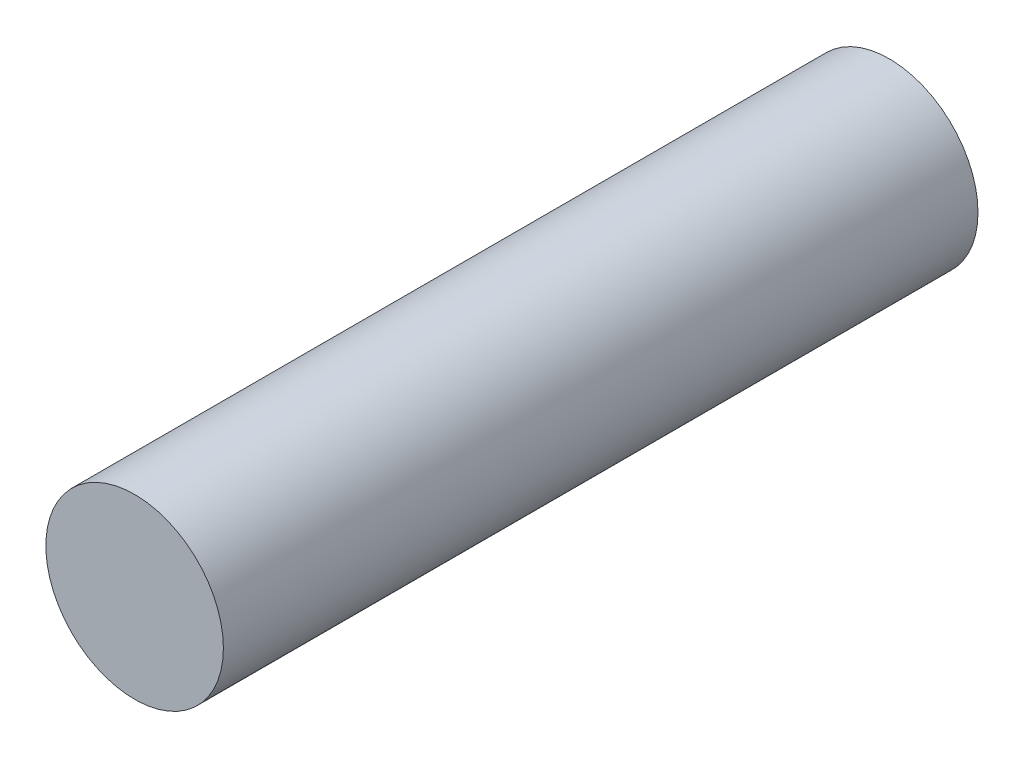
from build123d import *

# Parameters (mm, degrees)
SKETCH1_R           = 2
BOSS_EXTRUDE1_DEPTH = 8.5


with BuildPart() as part:
    # Sketch1 → Boss-Extrude1 (new, symmetric)
    with BuildSketch(Plane.XY):
        Circle(SKETCH1_R)
    extrude(amount=BOSS_EXTRUDE1_DEPTH, both=True)


solid = part.part
